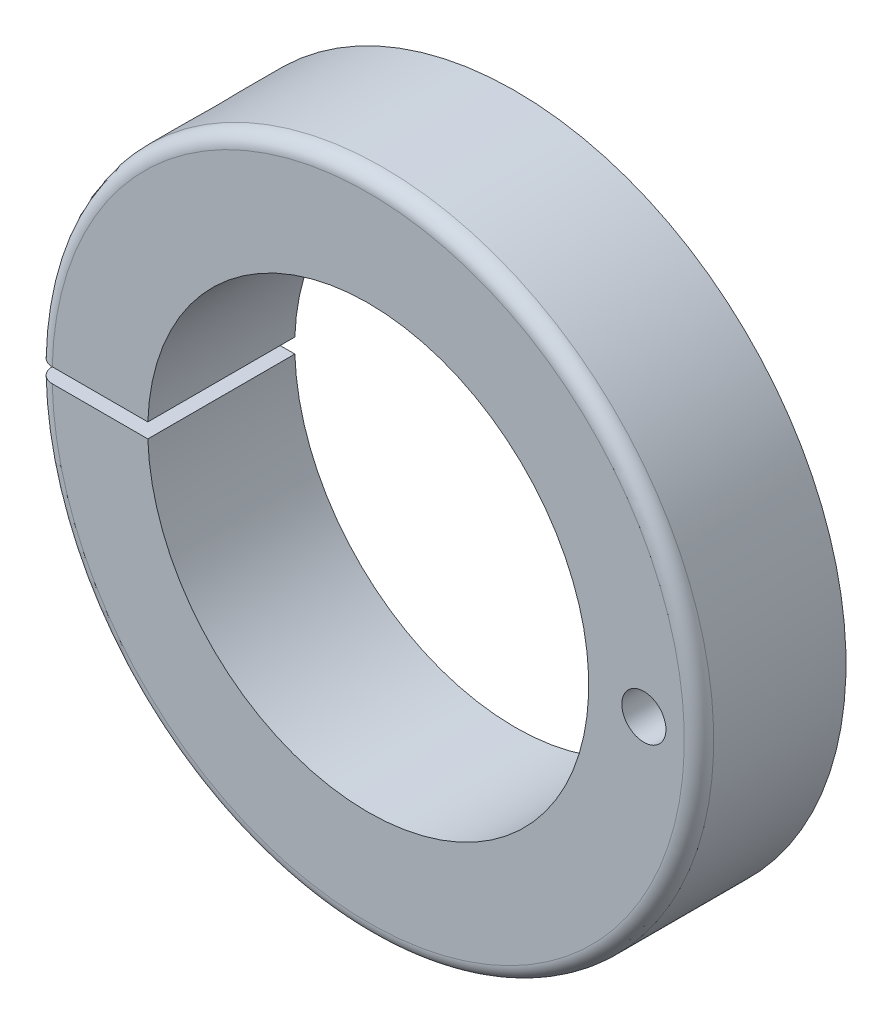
ISO-10303-21;
HEADER;
FILE_DESCRIPTION(('STEP AP214'),'2;1');
FILE_NAME('part.step','',(''),(''),'','','');
FILE_SCHEMA(('AUTOMOTIVE_DESIGN { 1 0 10303 214 1 1 1 1 }'));
ENDSEC;
DATA;
#1=APPLICATION_CONTEXT('core data for automotive mechanical design processes');
#2=APPLICATION_PROTOCOL_DEFINITION('international standard','automotive_design',2000,#1);
#3=PRODUCT_CONTEXT('',#1,'mechanical');
#4=PRODUCT('Part','Part','',(#3));
#5=PRODUCT_RELATED_PRODUCT_CATEGORY('part','',(#4));
#6=PRODUCT_DEFINITION_FORMATION('','',#4);
#7=PRODUCT_DEFINITION_CONTEXT('part definition',#1,'design');
#8=PRODUCT_DEFINITION('design','',#6,#7);
#9=PRODUCT_DEFINITION_SHAPE('','',#8);
#10=(LENGTH_UNIT() NAMED_UNIT(*) SI_UNIT(.MILLI.,.METRE.));
#11=(NAMED_UNIT(*) PLANE_ANGLE_UNIT() SI_UNIT($,.RADIAN.));
#12=(NAMED_UNIT(*) SI_UNIT($,.STERADIAN.) SOLID_ANGLE_UNIT());
#13=UNCERTAINTY_MEASURE_WITH_UNIT(LENGTH_MEASURE(1.E-05),#10,'distance_accuracy_value','');
#14=(GEOMETRIC_REPRESENTATION_CONTEXT(3) GLOBAL_UNCERTAINTY_ASSIGNED_CONTEXT((#13)) GLOBAL_UNIT_ASSIGNED_CONTEXT((#10,
#11,#12)) REPRESENTATION_CONTEXT('',''));
#15=CARTESIAN_POINT('',(0.,0.,0.));
#16=DIRECTION('',(0.,0.,1.));
#17=DIRECTION('',(1.,0.,0.));
#18=AXIS2_PLACEMENT_3D('',#15,#16,#17);
#19=CARTESIAN_POINT('',(-37.5,-45.,10.));
#20=DIRECTION('',(0.,1.,0.));
#21=DIRECTION('',(0.,0.,1.));
#22=AXIS2_PLACEMENT_3D('',#19,#20,#21);
#23=CYLINDRICAL_SURFACE('',#22,3.);
#24=CARTESIAN_POINT('',(-37.5,1.,10.));
#25=DIRECTION('',(0.,1.,0.));
#26=DIRECTION('',(0.,0.,1.));
#27=AXIS2_PLACEMENT_3D('',#24,#25,#26);
#28=CIRCLE('',#27,3.);
#29=CARTESIAN_POINT('',(-37.5,0.999999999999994,13.));
#30=VERTEX_POINT('',#29);
#31=EDGE_CURVE('E119',#30,#30,#28,.T.);
#32=CARTESIAN_POINT('',(-37.5,5.,10.));
#33=DIRECTION('',(0.,1.,0.));
#34=DIRECTION('',(0.,0.,1.));
#35=AXIS2_PLACEMENT_3D('',#32,#33,#34);
#36=CIRCLE('',#35,3.);
#37=CARTESIAN_POINT('',(-37.5,5.,13.));
#38=VERTEX_POINT('',#37);
#39=EDGE_CURVE('E124',#38,#38,#36,.F.);
#40=CARTESIAN_POINT('',(-37.5,0.999999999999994,13.));
#41=CARTESIAN_POINT('',(-37.5,1.04166666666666,13.));
#42=CARTESIAN_POINT('',(-37.5,1.08333333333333,13.));
#43=CARTESIAN_POINT('',(-37.5,1.16666666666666,13.));
#44=CARTESIAN_POINT('',(-37.5,1.20833333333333,13.));
#45=CARTESIAN_POINT('',(-37.5,1.29166666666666,13.));
#46=CARTESIAN_POINT('',(-37.5,1.33333333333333,13.));
#47=CARTESIAN_POINT('',(-37.5,1.41666666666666,13.));
#48=CARTESIAN_POINT('',(-37.5,1.45833333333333,13.));
#49=CARTESIAN_POINT('',(-37.5,1.54166666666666,13.));
#50=CARTESIAN_POINT('',(-37.5,1.58333333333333,13.));
#51=CARTESIAN_POINT('',(-37.5,1.66666666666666,13.));
#52=CARTESIAN_POINT('',(-37.5,1.70833333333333,13.));
#53=CARTESIAN_POINT('',(-37.5,1.79166666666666,13.));
#54=CARTESIAN_POINT('',(-37.5,1.83333333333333,13.));
#55=CARTESIAN_POINT('',(-37.5,1.91666666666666,13.));
#56=CARTESIAN_POINT('',(-37.5,1.95833333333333,13.));
#57=CARTESIAN_POINT('',(-37.5,2.04166666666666,13.));
#58=CARTESIAN_POINT('',(-37.5,2.08333333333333,13.));
#59=CARTESIAN_POINT('',(-37.5,2.16666666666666,13.));
#60=CARTESIAN_POINT('',(-37.5,2.20833333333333,13.));
#61=CARTESIAN_POINT('',(-37.5,2.29166666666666,13.));
#62=CARTESIAN_POINT('',(-37.5,2.33333333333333,13.));
#63=CARTESIAN_POINT('',(-37.5,2.41666666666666,13.));
#64=CARTESIAN_POINT('',(-37.5,2.45833333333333,13.));
#65=CARTESIAN_POINT('',(-37.5,2.54166666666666,13.));
#66=CARTESIAN_POINT('',(-37.5,2.58333333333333,13.));
#67=CARTESIAN_POINT('',(-37.5,2.66666666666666,13.));
#68=CARTESIAN_POINT('',(-37.5,2.70833333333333,13.));
#69=CARTESIAN_POINT('',(-37.5,2.79166666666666,13.));
#70=CARTESIAN_POINT('',(-37.5,2.83333333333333,13.));
#71=CARTESIAN_POINT('',(-37.5,2.91666666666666,13.));
#72=CARTESIAN_POINT('',(-37.5,2.95833333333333,13.));
#73=CARTESIAN_POINT('',(-37.5,3.04166666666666,13.));
#74=CARTESIAN_POINT('',(-37.5,3.08333333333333,13.));
#75=CARTESIAN_POINT('',(-37.5,3.16666666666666,13.));
#76=CARTESIAN_POINT('',(-37.5,3.20833333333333,13.));
#77=CARTESIAN_POINT('',(-37.5,3.29166666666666,13.));
#78=CARTESIAN_POINT('',(-37.5,3.33333333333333,13.));
#79=CARTESIAN_POINT('',(-37.5,3.41666666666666,13.));
#80=CARTESIAN_POINT('',(-37.5,3.45833333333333,13.));
#81=CARTESIAN_POINT('',(-37.5,3.54166666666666,13.));
#82=CARTESIAN_POINT('',(-37.5,3.58333333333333,13.));
#83=CARTESIAN_POINT('',(-37.5,3.66666666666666,13.));
#84=CARTESIAN_POINT('',(-37.5,3.70833333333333,13.));
#85=CARTESIAN_POINT('',(-37.5,3.79166666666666,13.));
#86=CARTESIAN_POINT('',(-37.5,3.83333333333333,13.));
#87=CARTESIAN_POINT('',(-37.5,3.91666666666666,13.));
#88=CARTESIAN_POINT('',(-37.5,3.95833333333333,13.));
#89=CARTESIAN_POINT('',(-37.5,4.04166666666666,13.));
#90=CARTESIAN_POINT('',(-37.5,4.08333333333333,13.));
#91=CARTESIAN_POINT('',(-37.5,4.16666666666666,13.));
#92=CARTESIAN_POINT('',(-37.5,4.20833333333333,13.));
#93=CARTESIAN_POINT('',(-37.5,4.29166666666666,13.));
#94=CARTESIAN_POINT('',(-37.5,4.33333333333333,13.));
#95=CARTESIAN_POINT('',(-37.5,4.41666666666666,13.));
#96=CARTESIAN_POINT('',(-37.5,4.45833333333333,13.));
#97=CARTESIAN_POINT('',(-37.5,4.54166666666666,13.));
#98=CARTESIAN_POINT('',(-37.5,4.58333333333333,13.));
#99=CARTESIAN_POINT('',(-37.5,4.66666666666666,13.));
#100=CARTESIAN_POINT('',(-37.5,4.70833333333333,13.));
#101=CARTESIAN_POINT('',(-37.5,4.79166666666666,13.));
#102=CARTESIAN_POINT('',(-37.5,4.83333333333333,13.));
#103=CARTESIAN_POINT('',(-37.5,4.91666666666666,13.));
#104=CARTESIAN_POINT('',(-37.5,4.95833333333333,13.));
#105=CARTESIAN_POINT('',(-37.5,5.,13.));
#106=B_SPLINE_CURVE_WITH_KNOTS('',3,(#40,#41,#42,#43,#44,#45,#46,#47,#48,#49,#50,#51,#52,#53,
#54,#55,#56,#57,#58,#59,#60,#61,#62,#63,#64,#65,#66,#67,#68,#69,#70,#71,#72,#73,#74,#75,#76,#77,
#78,#79,#80,#81,#82,#83,#84,#85,#86,#87,#88,#89,#90,#91,#92,#93,#94,#95,#96,#97,#98,#99,#100,
#101,#102,#103,#104,#105),.UNSPECIFIED.,.F.,.F.,(4,2,2,2,2,2,2,2,2,2,2,2,2,2,2,2,2,2,2,2,2,2,2,
2,2,2,2,2,2,2,2,2,4),(0.,0.125,0.25,0.375,0.5,0.625000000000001,0.750000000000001,
0.875000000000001,1.,1.125,1.25,1.375,1.5,1.625,1.75,1.875,2.,2.125,2.25,2.375,2.5,2.625,2.75,
2.875,3.,3.125,3.25,3.375,3.5,3.625,3.75,3.875,4.),.UNSPECIFIED.);
#107=EDGE_CURVE('BSEAM33',#30,#38,#106,.T.);
#108=ORIENTED_EDGE('',*,*,#31,.F.);
#109=ORIENTED_EDGE('',*,*,#39,.F.);
#110=ORIENTED_EDGE('',*,*,#107,.T.);
#111=ORIENTED_EDGE('',*,*,#107,.F.);
#112=EDGE_LOOP('',(#108,#110,#109,#111));
#113=FACE_BOUND('',#112,.T.);
#114=ADVANCED_FACE('F33',(#113),#23,.F.);
#115=CARTESIAN_POINT('',(0.,0.,20.));
#116=DIRECTION('',(0.,0.,-1.));
#117=DIRECTION('',(-1.,0.,0.));
#118=AXIS2_PLACEMENT_3D('',#115,#116,#117);
#119=CYLINDRICAL_SURFACE('',#118,45.);
#120=CARTESIAN_POINT('',(-37.5,24.8746859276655,17.));
#121=CARTESIAN_POINT('',(-37.8264549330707,24.382530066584,17.0000078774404));
#122=CARTESIAN_POINT('',(-38.1432428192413,23.8838821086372,16.977229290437));
#123=CARTESIAN_POINT('',(-38.7556311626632,22.8768191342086,16.893397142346));
#124=CARTESIAN_POINT('',(-39.0512212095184,22.3683994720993,16.8323249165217));
#125=CARTESIAN_POINT('',(-39.6210724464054,21.3428143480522,16.6774589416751));
#126=CARTESIAN_POINT('',(-39.8952710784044,20.8256282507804,16.5835733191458));
#127=CARTESIAN_POINT('',(-40.421051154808,19.7858034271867,16.3677477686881));
#128=CARTESIAN_POINT('',(-40.6726360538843,19.2631655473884,16.2458121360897));
#129=CARTESIAN_POINT('',(-41.0670923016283,18.4019310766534,16.0255293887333));
#130=CARTESIAN_POINT('',(-41.216615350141,18.0644939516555,15.9343864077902));
#131=CARTESIAN_POINT('',(-41.5064079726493,17.3883114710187,15.7427241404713));
#132=CARTESIAN_POINT('',(-41.6466777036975,17.0495661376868,15.6422050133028));
#133=CARTESIAN_POINT('',(-41.9180759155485,16.3709657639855,15.4323150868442));
#134=CARTESIAN_POINT('',(-42.0492000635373,16.0311102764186,15.322940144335));
#135=CARTESIAN_POINT('',(-42.3022943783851,15.3508174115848,15.0957714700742));
#136=CARTESIAN_POINT('',(-42.4242647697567,15.0103800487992,14.9779779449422));
#137=CARTESIAN_POINT('',(-42.6589133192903,14.3299131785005,14.7343605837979));
#138=CARTESIAN_POINT('',(-42.7716072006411,13.9898839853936,14.6085510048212));
#139=CARTESIAN_POINT('',(-42.9879918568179,13.3101374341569,14.3486264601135));
#140=CARTESIAN_POINT('',(-43.0916827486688,12.9704200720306,14.2145116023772));
#141=CARTESIAN_POINT('',(-43.2900398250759,12.2921610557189,13.937567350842));
#142=CARTESIAN_POINT('',(-43.3847114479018,11.9536188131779,13.7947432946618));
#143=CARTESIAN_POINT('',(-43.5650963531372,11.2784909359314,13.4992332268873));
#144=CARTESIAN_POINT('',(-43.6508111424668,10.9419049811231,13.3465488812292));
#145=CARTESIAN_POINT('',(-43.7659478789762,10.4672137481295,13.1214454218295));
#146=CARTESIAN_POINT('',(-43.7990943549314,10.3276213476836,13.0540393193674));
#147=CARTESIAN_POINT('',(-43.8637991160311,10.0492554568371,12.9168173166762));
#148=CARTESIAN_POINT('',(-43.8953574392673,9.91048194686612,12.8470014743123));
#149=CARTESIAN_POINT('',(-43.9568198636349,9.63420897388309,12.7047134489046));
#150=CARTESIAN_POINT('',(-43.9867264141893,9.49670789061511,12.6322454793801));
#151=CARTESIAN_POINT('',(-44.0449044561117,9.22312026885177,12.4840614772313));
#152=CARTESIAN_POINT('',(-44.0731760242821,9.08703366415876,12.4083455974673));
#153=CARTESIAN_POINT('',(-44.1355252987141,8.77987489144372,12.2317754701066));
#154=CARTESIAN_POINT('',(-44.1690810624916,8.60939392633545,12.1297014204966));
#155=CARTESIAN_POINT('',(-44.2333930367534,8.27262529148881,11.9167400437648));
#156=CARTESIAN_POINT('',(-44.264140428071,8.10635194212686,11.8058268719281));
#157=CARTESIAN_POINT('',(-44.3081612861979,7.86091839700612,11.6287230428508));
#158=CARTESIAN_POINT('',(-44.322657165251,7.77873934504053,11.5670326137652));
#159=CARTESIAN_POINT('',(-44.3506709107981,7.61739289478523,11.4396431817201));
#160=CARTESIAN_POINT('',(-44.3641891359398,7.53822439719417,11.3739456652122));
#161=CARTESIAN_POINT('',(-44.390041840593,7.38445913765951,11.2377837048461));
#162=CARTESIAN_POINT('',(-44.4023811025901,7.3098443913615,11.1673406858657));
#163=CARTESIAN_POINT('',(-44.4256667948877,7.1669614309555,11.02014447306));
#164=CARTESIAN_POINT('',(-44.4366154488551,7.09868313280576,10.9434016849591));
#165=CARTESIAN_POINT('',(-44.4539528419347,6.98915420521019,10.8037699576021));
#166=CARTESIAN_POINT('',(-44.460772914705,6.94559585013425,10.7427692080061));
#167=CARTESIAN_POINT('',(-44.473150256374,6.86589608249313,10.6158275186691));
#168=CARTESIAN_POINT('',(-44.4787069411,6.82975810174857,10.5498843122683));
#169=CARTESIAN_POINT('',(-44.4882173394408,6.76753517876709,10.411898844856));
#170=CARTESIAN_POINT('',(-44.4921450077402,6.74161388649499,10.339778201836));
#171=CARTESIAN_POINT('',(-44.497758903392,6.70446367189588,10.1918126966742));
#172=CARTESIAN_POINT('',(-44.4994522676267,6.69318796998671,10.1159804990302));
#173=CARTESIAN_POINT('',(-44.500265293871,6.68777897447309,9.9734616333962));
#174=CARTESIAN_POINT('',(-44.4996874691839,6.69163070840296,9.90685073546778));
#175=CARTESIAN_POINT('',(-44.4967076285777,6.71141594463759,9.77546340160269));
#176=CARTESIAN_POINT('',(-44.4943028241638,6.72736791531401,9.71068992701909));
#177=CARTESIAN_POINT('',(-44.4870799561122,6.77498537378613,9.56733982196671));
#178=CARTESIAN_POINT('',(-44.4817810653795,6.80975962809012,9.48984677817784));
#179=CARTESIAN_POINT('',(-44.4693319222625,6.8905870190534,9.34120216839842));
#180=CARTESIAN_POINT('',(-44.4621772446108,6.93666710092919,9.27006631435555));
#181=CARTESIAN_POINT('',(-44.4448038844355,7.04721014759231,9.11869133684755));
#182=CARTESIAN_POINT('',(-44.4342572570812,7.11349100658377,9.03984403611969));
#183=CARTESIAN_POINT('',(-44.4116723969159,7.25316427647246,8.88886844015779));
#184=CARTESIAN_POINT('',(-44.39963136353,7.32656998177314,8.81675321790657));
#185=CARTESIAN_POINT('',(-44.3742944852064,7.4784997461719,8.67746011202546));
#186=CARTESIAN_POINT('',(-44.3609914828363,7.55705210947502,8.61031477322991));
#187=CARTESIAN_POINT('',(-44.3333852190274,7.7173559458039,8.48038174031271));
#188=CARTESIAN_POINT('',(-44.3190828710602,7.79910446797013,8.4175901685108));
#189=CARTESIAN_POINT('',(-44.275544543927,8.04382230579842,8.23730139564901));
#190=CARTESIAN_POINT('',(-44.2450452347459,8.21007799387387,8.12458633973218));
#191=CARTESIAN_POINT('',(-44.1810511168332,8.54777044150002,7.90805475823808));
#192=CARTESIAN_POINT('',(-44.1475541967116,8.71921079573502,7.80424460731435));
#193=CARTESIAN_POINT('',(-44.0776976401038,9.06575303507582,7.6030749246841));
#194=CARTESIAN_POINT('',(-44.0413320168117,9.24086198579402,7.50572970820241));
#195=CARTESIAN_POINT('',(-43.965905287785,9.59331391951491,7.31626123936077));
#196=CARTESIAN_POINT('',(-43.9268439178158,9.77065712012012,7.22413850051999));
#197=CARTESIAN_POINT('',(-43.8460251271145,10.1271683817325,7.04403662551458));
#198=CARTESIAN_POINT('',(-43.804263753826,10.3063387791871,6.95606390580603));
#199=CARTESIAN_POINT('',(-43.7181277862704,10.6658089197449,6.78376755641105));
#200=CARTESIAN_POINT('',(-43.6737530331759,10.8461087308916,6.69944414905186));
#201=CARTESIAN_POINT('',(-43.5368560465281,11.387742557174,6.45146986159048));
#202=CARTESIAN_POINT('',(-43.4404536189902,11.7502863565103,6.29257840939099));
#203=CARTESIAN_POINT('',(-43.2374644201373,12.4765278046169,5.98561930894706));
#204=CARTESIAN_POINT('',(-43.1308898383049,12.8402235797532,5.83753907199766));
#205=CARTESIAN_POINT('',(-42.9074134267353,13.568304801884,5.55108118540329));
#206=CARTESIAN_POINT('',(-42.7905106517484,13.9326903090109,5.41270442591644));
#207=CARTESIAN_POINT('',(-42.5462198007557,14.6617573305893,5.14526170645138));
#208=CARTESIAN_POINT('',(-42.418822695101,15.0264388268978,5.01620394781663));
#209=CARTESIAN_POINT('',(-42.1535574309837,15.755252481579,4.76765496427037));
#210=CARTESIAN_POINT('',(-42.0156893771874,16.1193846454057,4.64816364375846));
#211=CARTESIAN_POINT('',(-41.7297895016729,16.8456691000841,4.4194715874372));
#212=CARTESIAN_POINT('',(-41.5817859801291,17.2078240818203,4.310244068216));
#213=CARTESIAN_POINT('',(-41.2752156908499,17.930719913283,4.10236948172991));
#214=CARTESIAN_POINT('',(-41.1166485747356,18.2914607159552,4.0037227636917));
#215=CARTESIAN_POINT('',(-40.7890107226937,19.010857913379,3.81794115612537));
#216=CARTESIAN_POINT('',(-40.6199466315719,19.3695154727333,3.73079909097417));
#217=CARTESIAN_POINT('',(-40.271235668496,20.0844656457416,3.56904456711));
#218=CARTESIAN_POINT('',(-40.0915898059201,20.4407584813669,3.49443091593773));
#219=CARTESIAN_POINT('',(-39.6801226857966,21.2303582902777,3.34377852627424));
#220=CARTESIAN_POINT('',(-39.4456555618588,21.662958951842,3.27119536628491));
#221=CARTESIAN_POINT('',(-38.9611098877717,22.5227755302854,3.14963127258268));
#222=CARTESIAN_POINT('',(-38.7110306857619,22.9499912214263,3.10065132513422));
#223=CARTESIAN_POINT('',(-38.1958070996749,23.7976108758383,3.02981480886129));
#224=CARTESIAN_POINT('',(-37.9306625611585,24.2180147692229,3.0079585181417));
#225=CARTESIAN_POINT('',(-37.3863425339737,25.0501163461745,2.9956309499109));
#226=CARTESIAN_POINT('',(-37.1071707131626,25.4618162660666,3.00515150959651));
#227=CARTESIAN_POINT('',(-36.6049575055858,26.1766989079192,3.05404031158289));
#228=CARTESIAN_POINT('',(-36.3845087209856,26.4822305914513,3.08570397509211));
#229=CARTESIAN_POINT('',(-35.9376238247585,27.0855689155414,3.17278861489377));
#230=CARTESIAN_POINT('',(-35.7111872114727,27.3833749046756,3.22821158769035));
#231=CARTESIAN_POINT('',(-35.2544094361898,27.9689881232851,3.3656857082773));
#232=CARTESIAN_POINT('',(-35.0240751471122,28.2568106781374,3.44769384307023));
#233=CARTESIAN_POINT('',(-34.561586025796,28.820643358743,3.64165415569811));
#234=CARTESIAN_POINT('',(-34.3294321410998,29.0966592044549,3.75359163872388));
#235=CARTESIAN_POINT('',(-33.9477187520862,29.5398987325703,3.96585797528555));
#236=CARTESIAN_POINT('',(-33.7977001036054,29.7113771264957,4.05652912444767));
#237=CARTESIAN_POINT('',(-33.499549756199,30.0471382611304,4.25297728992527));
#238=CARTESIAN_POINT('',(-33.3514175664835,30.2114229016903,4.35875028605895));
#239=CARTESIAN_POINT('',(-33.0585804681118,30.5315780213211,4.58630211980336));
#240=CARTESIAN_POINT('',(-32.9138732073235,30.6874543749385,4.70806957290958));
#241=CARTESIAN_POINT('',(-32.6296668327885,30.9894810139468,4.96839590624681));
#242=CARTESIAN_POINT('',(-32.49016651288,31.1356335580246,5.10695086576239));
#243=CARTESIAN_POINT('',(-32.1412524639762,31.4965592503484,5.48532513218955));
#244=CARTESIAN_POINT('',(-31.937002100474,31.7033017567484,5.73804497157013));
#245=CARTESIAN_POINT('',(-31.651874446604,31.9871392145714,6.14937397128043));
#246=CARTESIAN_POINT('',(-31.5603811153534,32.0773647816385,6.29184301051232));
#247=CARTESIAN_POINT('',(-31.3858030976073,32.2481969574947,6.58737578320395));
#248=CARTESIAN_POINT('',(-31.3027169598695,32.328805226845,6.74043768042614));
#249=CARTESIAN_POINT('',(-31.1599236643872,32.4664018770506,7.0293509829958));
#250=CARTESIAN_POINT('',(-31.0986532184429,32.5250682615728,7.16363525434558));
#251=CARTESIAN_POINT('',(-30.9837818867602,32.6345146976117,7.43853951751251));
#252=CARTESIAN_POINT('',(-30.9301794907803,32.685296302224,7.57915825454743));
#253=CARTESIAN_POINT('',(-30.831476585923,32.7784176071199,7.8660365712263));
#254=CARTESIAN_POINT('',(-30.7863742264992,32.8207591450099,8.01229491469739));
#255=CARTESIAN_POINT('',(-30.7054170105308,32.8965111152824,8.30962188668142));
#256=CARTESIAN_POINT('',(-30.6695622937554,32.9299214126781,8.46069058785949));
#257=CARTESIAN_POINT('',(-30.6076002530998,32.9875220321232,8.76735472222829));
#258=CARTESIAN_POINT('',(-30.581541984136,33.0116659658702,8.92296883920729));
#259=CARTESIAN_POINT('',(-30.5399296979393,33.0501664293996,9.23679972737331));
#260=CARTESIAN_POINT('',(-30.5243757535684,33.0645228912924,9.39501651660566));
#261=CARTESIAN_POINT('',(-30.5040878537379,33.0832407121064,9.71269943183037));
#262=CARTESIAN_POINT('',(-30.4993516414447,33.0876041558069,9.8721652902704));
#263=CARTESIAN_POINT('',(-30.5007908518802,33.0862775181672,10.1909995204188));
#264=CARTESIAN_POINT('',(-30.5069655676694,33.0805880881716,10.3503678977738));
#265=CARTESIAN_POINT('',(-30.5291249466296,33.0601380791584,10.6543252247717));
#266=CARTESIAN_POINT('',(-30.5442435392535,33.0461782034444,10.7990328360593));
#267=CARTESIAN_POINT('',(-30.583278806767,33.0100555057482,11.086269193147));
#268=CARTESIAN_POINT('',(-30.6071984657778,32.9878899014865,11.2287971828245));
#269=CARTESIAN_POINT('',(-30.663434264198,32.93562309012,11.5106323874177));
#270=CARTESIAN_POINT('',(-30.6957467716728,32.9055253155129,11.6499409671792));
#271=CARTESIAN_POINT('',(-30.76828540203,32.8377081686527,11.9246324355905));
#272=CARTESIAN_POINT('',(-30.8085144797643,32.7999859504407,12.0600138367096));
#273=CARTESIAN_POINT('',(-30.8975206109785,32.716158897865,12.3298052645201));
#274=CARTESIAN_POINT('',(-30.9465040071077,32.6698503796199,12.4640839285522));
#275=CARTESIAN_POINT('',(-31.0515200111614,32.5700531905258,12.7271221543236));
#276=CARTESIAN_POINT('',(-31.107555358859,32.5165617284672,12.8558795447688));
#277=CARTESIAN_POINT('',(-31.2851790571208,32.3460109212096,13.2331283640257));
#278=CARTESIAN_POINT('',(-31.4163260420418,32.2188369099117,13.4727178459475));
#279=CARTESIAN_POINT('',(-31.6579513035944,31.9811527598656,13.8609564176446));
#280=CARTESIAN_POINT('',(-31.7637095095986,31.8761800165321,14.0160980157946));
#281=CARTESIAN_POINT('',(-31.9832916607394,31.6558579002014,14.3127684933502));
#282=CARTESIAN_POINT('',(-32.0971183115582,31.540505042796,14.4542927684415));
#283=CARTESIAN_POINT('',(-32.4483303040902,31.1804043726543,14.858833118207));
#284=CARTESIAN_POINT('',(-32.6952529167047,30.9218040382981,15.1015145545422));
#285=CARTESIAN_POINT('',(-33.1276803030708,30.4569615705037,15.4716075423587));
#286=CARTESIAN_POINT('',(-33.309957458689,30.2576088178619,15.6119511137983));
#287=CARTESIAN_POINT('',(-33.6782207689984,29.8471661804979,15.8689335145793));
#288=CARTESIAN_POINT('',(-33.864208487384,29.6360712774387,15.985562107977));
#289=CARTESIAN_POINT('',(-34.2375200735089,29.2040049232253,16.1969602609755));
#290=CARTESIAN_POINT('',(-34.424845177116,28.9830229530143,16.2917058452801));
#291=CARTESIAN_POINT('',(-34.7987688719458,28.5329857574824,16.4610728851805));
#292=CARTESIAN_POINT('',(-34.9853675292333,28.3039312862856,16.5356962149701));
#293=CARTESIAN_POINT('',(-35.3732459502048,27.8179560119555,16.6725531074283));
#294=CARTESIAN_POINT('',(-35.5743248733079,27.5603901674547,16.7330525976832));
#295=CARTESIAN_POINT('',(-35.9725843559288,27.0385089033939,16.8344145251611));
#296=CARTESIAN_POINT('',(-36.1697646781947,26.7741930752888,16.8752757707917));
#297=CARTESIAN_POINT('',(-36.5590890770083,26.2400864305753,16.9392779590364));
#298=CARTESIAN_POINT('',(-36.7512365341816,25.9702995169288,16.9624311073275));
#299=CARTESIAN_POINT('',(-37.1299415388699,25.4259214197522,16.9927914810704));
#300=CARTESIAN_POINT('',(-37.3164979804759,25.1513293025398,16.9999955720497));
#301=CARTESIAN_POINT('',(-37.5,24.8746859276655,17.));
#302=B_SPLINE_CURVE_WITH_KNOTS('',3,(#120,#121,#122,#123,#124,#125,#126,#127,#128,#129,#130,
#131,#132,#133,#134,#135,#136,#137,#138,#139,#140,#141,#142,#143,#144,#145,#146,#147,#148,#149,
#150,#151,#152,#153,#154,#155,#156,#157,#158,#159,#160,#161,#162,#163,#164,#165,#166,#167,#168,
#169,#170,#171,#172,#173,#174,#175,#176,#177,#178,#179,#180,#181,#182,#183,#184,#185,#186,#187,
#188,#189,#190,#191,#192,#193,#194,#195,#196,#197,#198,#199,#200,#201,#202,#203,#204,#205,#206,
#207,#208,#209,#210,#211,#212,#213,#214,#215,#216,#217,#218,#219,#220,#221,#222,#223,#224,#225,
#226,#227,#228,#229,#230,#231,#232,#233,#234,#235,#236,#237,#238,#239,#240,#241,#242,#243,#244,
#245,#246,#247,#248,#249,#250,#251,#252,#253,#254,#255,#256,#257,#258,#259,#260,#261,#262,#263,
#264,#265,#266,#267,#268,#269,#270,#271,#272,#273,#274,#275,#276,#277,#278,#279,#280,#281,#282,
#283,#284,#285,#286,#287,#288,#289,#290,#291,#292,#293,#294,#295,#296,#297,#298,#299,#300,#301),
.UNSPECIFIED.,.T.,.F.,(4,2,2,2,2,2,2,2,2,2,2,2,2,2,2,2,2,2,2,2,2,2,2,2,2,2,2,2,2,2,2,2,2,2,2,2,
2,2,2,2,2,2,2,2,2,2,2,2,2,2,2,2,2,2,2,2,2,2,2,2,2,2,2,2,2,2,2,2,2,2,2,2,2,2,2,2,2,2,2,2,2,2,2,2,
2,2,2,2,2,2,4),(0.,1.77148044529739,3.54382500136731,5.3211721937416,7.09824739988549,
8.23854255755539,9.37881835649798,10.5196307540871,11.6604151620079,12.7992243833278,
13.9380187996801,15.0761221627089,16.214033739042,16.6895695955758,17.1650940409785,
17.639893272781,18.1146701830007,18.7190595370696,19.3252859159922,19.6365203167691,
19.947639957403,20.2574385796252,20.5667354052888,20.7921401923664,21.0176489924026,
21.2466359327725,21.4748896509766,21.6738390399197,21.8730926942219,22.1269668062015,
22.3814519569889,22.6913646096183,23.0018670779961,23.3142499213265,23.6263508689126,
24.2353487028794,24.844778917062,25.4555164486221,26.0663139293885,26.67802674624,
27.289776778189,28.5116529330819,29.7320828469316,30.9526245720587,32.1742276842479,
33.3958185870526,34.6141276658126,35.8324769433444,37.0500626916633,38.2675324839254,
39.7588915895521,41.2503130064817,42.7417497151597,44.2327984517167,45.3663095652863,
46.4999159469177,47.6316973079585,48.7629240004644,49.4980793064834,50.233039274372,
50.9674789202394,51.7017473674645,52.8519835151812,53.4269891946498,54.0018954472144,
54.4779315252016,54.9538737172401,55.4297121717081,55.9055578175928,56.383755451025,
56.8619564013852,57.3400575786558,57.81812777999,58.2561076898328,58.6942362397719,
59.1321755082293,59.5702785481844,60.0205469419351,60.4709908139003,61.3714813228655,
62.0160286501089,62.6607931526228,63.9515261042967,64.8636873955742,65.7762415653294,
66.6897908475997,67.6032550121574,68.5994446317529,69.5956946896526,70.5912574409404,
71.5870158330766),.UNSPECIFIED.);
#303=CARTESIAN_POINT('',(-37.5,24.8746859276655,17.));
#304=VERTEX_POINT('',#303);
#305=EDGE_CURVE('E123',#304,#304,#302,.T.);
#306=ORIENTED_EDGE('',*,*,#305,.T.);
#307=EDGE_LOOP('',(#306));
#308=FACE_BOUND('',#307,.T.);
#309=CARTESIAN_POINT('',(-37.5,-24.8746859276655,13.));
#310=CARTESIAN_POINT('',(-37.3637731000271,-25.0800558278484,12.9999995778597));
#311=CARTESIAN_POINT('',(-37.2258500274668,-25.2843131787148,12.9907483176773));
#312=CARTESIAN_POINT('',(-36.9474715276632,-25.6893895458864,12.9520290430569));
#313=CARTESIAN_POINT('',(-36.8070148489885,-25.8902067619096,12.9225507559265));
#314=CARTESIAN_POINT('',(-36.5258886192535,-26.2853169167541,12.8411971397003));
#315=CARTESIAN_POINT('',(-36.3852255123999,-26.4796420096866,12.7894585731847));
#316=CARTESIAN_POINT('',(-36.1051013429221,-26.8603290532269,12.6604534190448));
#317=CARTESIAN_POINT('',(-35.9656387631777,-27.0467028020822,12.5832262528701));
#318=CARTESIAN_POINT('',(-35.7207735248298,-27.3689257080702,12.4189144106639));
#319=CARTESIAN_POINT('',(-35.6145049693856,-27.507010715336,12.3375360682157));
#320=CARTESIAN_POINT('',(-35.4070910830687,-27.7734821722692,12.1538225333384));
#321=CARTESIAN_POINT('',(-35.3059522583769,-27.9018564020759,12.0514615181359));
#322=CARTESIAN_POINT('',(-35.160659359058,-28.0844129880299,11.8796779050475));
#323=CARTESIAN_POINT('',(-35.1129957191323,-28.1439679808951,11.8188989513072));
#324=CARTESIAN_POINT('',(-35.0208001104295,-28.2586089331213,11.6910949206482));
#325=CARTESIAN_POINT('',(-34.976268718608,-28.3136940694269,11.6240686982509));
#326=CARTESIAN_POINT('',(-34.848893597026,-28.4705557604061,11.4136260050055));
#327=CARTESIAN_POINT('',(-34.7717875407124,-28.564540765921,11.2603000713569));
#328=CARTESIAN_POINT('',(-34.6672411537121,-28.6912250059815,10.9936514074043));
#329=CARTESIAN_POINT('',(-34.6321323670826,-28.7335611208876,10.8878429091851));
#330=CARTESIAN_POINT('',(-34.5732674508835,-28.8043623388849,10.6686302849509));
#331=CARTESIAN_POINT('',(-34.5495020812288,-28.8328387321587,10.5552324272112));
#332=CARTESIAN_POINT('',(-34.5151024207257,-28.8740101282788,10.3228795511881));
#333=CARTESIAN_POINT('',(-34.5045486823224,-28.8866083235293,10.2038949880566));
#334=CARTESIAN_POINT('',(-34.4978272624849,-28.8946352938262,9.96494132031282));
#335=CARTESIAN_POINT('',(-34.5016562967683,-28.8900679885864,9.84497244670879));
#336=CARTESIAN_POINT('',(-34.5223785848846,-28.8653007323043,9.61842667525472));
#337=CARTESIAN_POINT('',(-34.5381195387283,-28.8464795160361,9.51158559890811));
#338=CARTESIAN_POINT('',(-34.5801190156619,-28.7961184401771,9.30313708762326));
#339=CARTESIAN_POINT('',(-34.6063814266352,-28.7645738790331,9.20153160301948));
#340=CARTESIAN_POINT('',(-34.6776399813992,-28.6786554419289,8.97400734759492));
#341=CARTESIAN_POINT('',(-34.7259393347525,-28.6202095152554,8.85066472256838));
#342=CARTESIAN_POINT('',(-34.8342090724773,-28.4883340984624,8.6179295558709));
#343=CARTESIAN_POINT('',(-34.8942009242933,-28.4148770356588,8.50856329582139));
#344=CARTESIAN_POINT('',(-35.0500326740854,-28.2226193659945,8.26004066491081));
#345=CARTESIAN_POINT('',(-35.1502098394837,-28.0978861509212,8.12823460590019));
#346=CARTESIAN_POINT('',(-35.3604970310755,-27.8327871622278,7.89103084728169));
#347=CARTESIAN_POINT('',(-35.4706267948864,-27.6923901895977,7.78568726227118));
#348=CARTESIAN_POINT('',(-35.6725726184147,-27.4315304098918,7.6180042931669));
#349=CARTESIAN_POINT('',(-35.7633936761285,-27.3130507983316,7.55127900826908));
#350=CARTESIAN_POINT('',(-35.946976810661,-27.0709796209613,7.43091891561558));
#351=CARTESIAN_POINT('',(-36.0397399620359,-26.9473851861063,7.37729157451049));
#352=CARTESIAN_POINT('',(-36.2261857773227,-26.696216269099,7.28184351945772));
#353=CARTESIAN_POINT('',(-36.319869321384,-26.568637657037,7.24003554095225));
#354=CARTESIAN_POINT('',(-36.5073192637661,-26.3104754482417,7.16721106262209));
#355=CARTESIAN_POINT('',(-36.6010856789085,-26.1798909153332,7.13619797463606));
#356=CARTESIAN_POINT('',(-36.8402142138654,-25.8430223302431,7.06954656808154));
#357=CARTESIAN_POINT('',(-36.985228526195,-25.6350816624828,7.04095132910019));
#358=CARTESIAN_POINT('',(-37.2725685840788,-25.2154794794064,7.00513106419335));
#359=CARTESIAN_POINT('',(-37.4148926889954,-25.0038158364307,6.99791868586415));
#360=CARTESIAN_POINT('',(-37.6961544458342,-24.5777391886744,7.0031090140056));
#361=CARTESIAN_POINT('',(-37.8350824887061,-24.3633205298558,7.01556201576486));
#362=CARTESIAN_POINT('',(-38.1083752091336,-23.9335865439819,7.05907828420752));
#363=CARTESIAN_POINT('',(-38.2427413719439,-23.7182715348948,7.09013543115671));
#364=CARTESIAN_POINT('',(-38.5112104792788,-23.2799301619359,7.17194862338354));
#365=CARTESIAN_POINT('',(-38.6451197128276,-23.0569132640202,7.22339105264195));
#366=CARTESIAN_POINT('',(-38.9068381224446,-22.6124838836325,7.34636850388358));
#367=CARTESIAN_POINT('',(-39.034642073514,-22.3910729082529,7.4179203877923));
#368=CARTESIAN_POINT('',(-39.2209339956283,-22.0620550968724,7.54156159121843));
#369=CARTESIAN_POINT('',(-39.2821375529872,-21.9528831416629,7.58550186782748));
#370=CARTESIAN_POINT('',(-39.4025732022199,-21.7359746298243,7.6792149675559));
#371=CARTESIAN_POINT('',(-39.4618056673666,-21.6282378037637,7.72898667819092));
#372=CARTESIAN_POINT('',(-39.5779822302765,-21.4149025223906,7.83478589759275));
#373=CARTESIAN_POINT('',(-39.6349302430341,-21.3093005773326,7.89080202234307));
#374=CARTESIAN_POINT('',(-39.7463555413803,-21.1007391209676,8.00988890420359));
#375=CARTESIAN_POINT('',(-39.8008323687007,-20.9977801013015,8.07296096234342));
#376=CARTESIAN_POINT('',(-39.9015812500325,-20.8056335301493,8.20046176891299));
#377=CARTESIAN_POINT('',(-39.948131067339,-20.7160931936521,8.26413492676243));
#378=CARTESIAN_POINT('',(-40.0383069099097,-20.5412666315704,8.39888495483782));
#379=CARTESIAN_POINT('',(-40.0819350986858,-20.4559772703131,8.46995624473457));
#380=CARTESIAN_POINT('',(-40.1651701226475,-20.2920546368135,8.62008031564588));
#381=CARTESIAN_POINT('',(-40.2048082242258,-20.213370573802,8.6990594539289));
#382=CARTESIAN_POINT('',(-40.2792260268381,-20.0646660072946,8.86673258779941));
#383=CARTESIAN_POINT('',(-40.3140167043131,-19.9946259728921,8.95540379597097));
#384=CARTESIAN_POINT('',(-40.3685420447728,-19.8842538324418,9.1186592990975));
#385=CARTESIAN_POINT('',(-40.3898194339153,-19.8409763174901,9.19071167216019));
#386=CARTESIAN_POINT('',(-40.4277215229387,-19.7636329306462,9.34088197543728));
#387=CARTESIAN_POINT('',(-40.4443456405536,-19.7295682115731,9.41900066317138));
#388=CARTESIAN_POINT('',(-40.4718169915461,-19.6731553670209,9.58148938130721));
#389=CARTESIAN_POINT('',(-40.4825961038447,-19.6509454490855,9.66592060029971));
#390=CARTESIAN_POINT('',(-40.4968553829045,-19.6215441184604,9.83793423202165));
#391=CARTESIAN_POINT('',(-40.5003470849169,-19.6143289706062,9.92551144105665));
#392=CARTESIAN_POINT('',(-40.4996366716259,-19.6157950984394,10.0911421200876));
#393=CARTESIAN_POINT('',(-40.4962129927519,-19.6228680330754,10.1692183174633));
#394=CARTESIAN_POINT('',(-40.483573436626,-19.6489308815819,10.3228734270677));
#395=CARTESIAN_POINT('',(-40.474352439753,-19.6679313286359,10.3984500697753));
#396=CARTESIAN_POINT('',(-40.4475700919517,-19.7229623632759,10.5665857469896));
#397=CARTESIAN_POINT('',(-40.4283727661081,-19.7623192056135,10.6577777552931));
#398=CARTESIAN_POINT('',(-40.3837143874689,-19.8534171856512,10.832068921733));
#399=CARTESIAN_POINT('',(-40.3582395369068,-19.9051855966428,10.9151496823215));
#400=CARTESIAN_POINT('',(-40.3073548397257,-20.0079950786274,11.0600063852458));
#401=CARTESIAN_POINT('',(-40.2826564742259,-20.0576905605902,11.1230140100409));
#402=CARTESIAN_POINT('',(-40.2307085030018,-20.1616836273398,11.2440108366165));
#403=CARTESIAN_POINT('',(-40.2034571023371,-20.2159844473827,11.3019964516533));
#404=CARTESIAN_POINT('',(-40.118541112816,-20.3842675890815,11.469343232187));
#405=CARTESIAN_POINT('',(-40.0577929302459,-20.5034718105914,11.5718848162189));
#406=CARTESIAN_POINT('',(-39.9307728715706,-20.7497624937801,11.7619135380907));
#407=CARTESIAN_POINT('',(-39.8645136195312,-20.876830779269,11.8494337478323));
#408=CARTESIAN_POINT('',(-39.7275183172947,-21.1363630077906,12.0123330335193));
#409=CARTESIAN_POINT('',(-39.6567780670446,-21.2688319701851,12.0877004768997));
#410=CARTESIAN_POINT('',(-39.5115484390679,-21.5374301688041,12.2279749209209));
#411=CARTESIAN_POINT('',(-39.4370541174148,-21.6735641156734,12.2928676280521));
#412=CARTESIAN_POINT('',(-39.2848669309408,-21.9482096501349,12.4132245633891));
#413=CARTESIAN_POINT('',(-39.2071731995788,-22.0867218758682,12.4686862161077));
#414=CARTESIAN_POINT('',(-39.0043677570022,-22.4437501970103,12.5997301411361));
#415=CARTESIAN_POINT('',(-38.8771873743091,-22.663402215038,12.6690594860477));
#416=CARTESIAN_POINT('',(-38.6166954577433,-23.1044699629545,12.7880962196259));
#417=CARTESIAN_POINT('',(-38.4833807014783,-23.3258865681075,12.8377931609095));
#418=CARTESIAN_POINT('',(-38.2110638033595,-23.7693592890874,12.917974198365));
#419=CARTESIAN_POINT('',(-38.0720503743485,-23.9914157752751,12.9484179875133));
#420=CARTESIAN_POINT('',(-37.7893364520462,-24.4343004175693,12.9894278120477));
#421=CARTESIAN_POINT('',(-37.6456375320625,-24.6551289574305,13.000000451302));
#422=CARTESIAN_POINT('',(-37.5,-24.8746859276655,13.));
#423=B_SPLINE_CURVE_WITH_KNOTS('',3,(#309,#310,#311,#312,#313,#314,#315,#316,#317,#318,#319,
#320,#321,#322,#323,#324,#325,#326,#327,#328,#329,#330,#331,#332,#333,#334,#335,#336,#337,#338,
#339,#340,#341,#342,#343,#344,#345,#346,#347,#348,#349,#350,#351,#352,#353,#354,#355,#356,#357,
#358,#359,#360,#361,#362,#363,#364,#365,#366,#367,#368,#369,#370,#371,#372,#373,#374,#375,#376,
#377,#378,#379,#380,#381,#382,#383,#384,#385,#386,#387,#388,#389,#390,#391,#392,#393,#394,#395,
#396,#397,#398,#399,#400,#401,#402,#403,#404,#405,#406,#407,#408,#409,#410,#411,#412,#413,#414,
#415,#416,#417,#418,#419,#420,#421,#422),.UNSPECIFIED.,.T.,.F.,(4,2,2,2,2,2,2,2,2,2,2,2,2,2,2,2,
2,2,2,2,2,2,2,2,2,2,2,2,2,2,2,2,2,2,2,2,2,2,2,2,2,2,2,2,2,2,2,2,2,2,2,2,2,2,2,2,4),(0.,
0.739135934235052,1.47864753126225,2.21367918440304,2.94757930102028,3.52339895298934,
4.09993155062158,4.39220354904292,4.68452924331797,5.26638438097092,5.62282509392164,
5.97897496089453,6.3372858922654,6.69551500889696,7.0229244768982,7.35045504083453,
7.78240806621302,8.21516175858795,8.8335829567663,9.45325868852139,9.94315466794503,
10.4333292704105,10.9240300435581,11.4148857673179,12.1791079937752,12.9437821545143,
13.7104151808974,14.4767961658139,15.271535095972,16.0669424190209,16.4647628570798,
16.8625075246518,17.2595385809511,17.6566429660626,18.0143449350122,18.3717790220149,
18.7261490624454,19.079703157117,19.3391582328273,19.5986457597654,19.8610958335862,
20.1231301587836,20.3573087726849,20.5916944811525,20.8934889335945,21.1959527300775,
21.4474817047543,21.6991888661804,22.203417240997,22.706520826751,23.2101031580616,
23.7143669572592,24.2187682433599,25.0071618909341,25.7959745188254,26.5864331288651,
27.3766289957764),.UNSPECIFIED.);
#424=CARTESIAN_POINT('',(-37.5,-24.8746859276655,13.));
#425=VERTEX_POINT('',#424);
#426=EDGE_CURVE('E148',#425,#425,#423,.T.);
#427=ORIENTED_EDGE('',*,*,#426,.T.);
#428=EDGE_LOOP('',(#427));
#429=FACE_BOUND('',#428,.T.);
#430=DIRECTION('',(0.,0.,-1.));
#431=VECTOR('',#430,1.);
#432=CARTESIAN_POINT('',(-44.988887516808,0.999999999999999,20.));
#433=LINE('',#432,#431);
#434=CARTESIAN_POINT('',(-44.988887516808,0.999999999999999,0.));
#435=VERTEX_POINT('',#434);
#436=CARTESIAN_POINT('',(-44.988887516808,0.999999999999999,18.));
#437=VERTEX_POINT('',#436);
#438=EDGE_CURVE('E108',#435,#437,#433,.F.);
#439=ORIENTED_EDGE('',*,*,#438,.T.);
#440=CARTESIAN_POINT('',(0.,0.,18.));
#441=DIRECTION('',(0.,0.,1.));
#442=DIRECTION('',(1.,0.,0.));
#443=AXIS2_PLACEMENT_3D('',#440,#441,#442);
#444=CIRCLE('',#443,45.);
#445=CARTESIAN_POINT('',(-44.988887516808,-0.999999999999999,18.));
#446=VERTEX_POINT('',#445);
#447=EDGE_CURVE('E47',#437,#446,#444,.F.);
#448=ORIENTED_EDGE('',*,*,#447,.T.);
#449=DIRECTION('',(0.,0.,-1.));
#450=VECTOR('',#449,1.);
#451=CARTESIAN_POINT('',(-44.988887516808,-0.999999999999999,20.));
#452=LINE('',#451,#450);
#453=CARTESIAN_POINT('',(-44.988887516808,-0.999999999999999,0.));
#454=VERTEX_POINT('',#453);
#455=EDGE_CURVE('E112',#446,#454,#452,.T.);
#456=ORIENTED_EDGE('',*,*,#455,.T.);
#457=CARTESIAN_POINT('',(0.,0.,0.));
#458=DIRECTION('',(0.,0.,1.));
#459=DIRECTION('',(1.,0.,0.));
#460=AXIS2_PLACEMENT_3D('',#457,#458,#459);
#461=CIRCLE('',#460,45.);
#462=EDGE_CURVE('E110',#454,#435,#461,.T.);
#463=ORIENTED_EDGE('',*,*,#462,.T.);
#464=EDGE_LOOP('',(#439,#448,#456,#463));
#465=FACE_BOUND('',#464,.T.);
#466=ADVANCED_FACE('F35',(#308,#429,#465),#119,.T.);
#467=CARTESIAN_POINT('',(0.,0.,20.));
#468=DIRECTION('',(0.,0.,1.));
#469=DIRECTION('',(1.,0.,0.));
#470=AXIS2_PLACEMENT_3D('',#467,#468,#469);
#471=PLANE('',#470);
#472=CARTESIAN_POINT('',(37.5,0.,20.));
#473=DIRECTION('',(0.,0.,1.));
#474=DIRECTION('',(1.,0.,0.));
#475=AXIS2_PLACEMENT_3D('',#472,#473,#474);
#476=CIRCLE('',#475,3.);
#477=CARTESIAN_POINT('',(40.5,0.,20.));
#478=VERTEX_POINT('',#477);
#479=EDGE_CURVE('E196',#478,#478,#476,.T.);
#480=ORIENTED_EDGE('',*,*,#479,.F.);
#481=EDGE_LOOP('',(#480));
#482=FACE_BOUND('',#481,.T.);
#483=DIRECTION('',(1.,0.,0.));
#484=VECTOR('',#483,1.);
#485=CARTESIAN_POINT('',(-50.,-0.999999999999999,20.));
#486=LINE('',#485,#484);
#487=CARTESIAN_POINT('',(-42.9883705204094,-0.999999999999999,20.));
#488=VERTEX_POINT('',#487);
#489=CARTESIAN_POINT('',(-29.9833287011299,-0.999999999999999,20.));
#490=VERTEX_POINT('',#489);
#491=EDGE_CURVE('E103',#488,#490,#486,.T.);
#492=ORIENTED_EDGE('',*,*,#491,.F.);
#493=CARTESIAN_POINT('',(0.,0.,20.));
#494=DIRECTION('',(0.,0.,1.));
#495=DIRECTION('',(1.,0.,0.));
#496=AXIS2_PLACEMENT_3D('',#493,#494,#495);
#497=CIRCLE('',#496,43.);
#498=CARTESIAN_POINT('',(-42.9883705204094,0.999999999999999,20.));
#499=VERTEX_POINT('',#498);
#500=EDGE_CURVE('E92',#488,#499,#497,.T.);
#501=ORIENTED_EDGE('',*,*,#500,.T.);
#502=DIRECTION('',(-1.,0.,0.));
#503=VECTOR('',#502,1.);
#504=CARTESIAN_POINT('',(-50.,0.999999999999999,20.));
#505=LINE('',#504,#503);
#506=CARTESIAN_POINT('',(-29.9833287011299,0.999999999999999,20.));
#507=VERTEX_POINT('',#506);
#508=EDGE_CURVE('E85',#507,#499,#505,.T.);
#509=ORIENTED_EDGE('',*,*,#508,.F.);
#510=CARTESIAN_POINT('',(0.,0.,20.));
#511=DIRECTION('',(0.,0.,1.));
#512=DIRECTION('',(1.,0.,0.));
#513=AXIS2_PLACEMENT_3D('',#510,#511,#512);
#514=CIRCLE('',#513,30.);
#515=EDGE_CURVE('E100',#490,#507,#514,.T.);
#516=ORIENTED_EDGE('',*,*,#515,.F.);
#517=EDGE_LOOP('',(#492,#501,#509,#516));
#518=FACE_BOUND('',#517,.T.);
#519=ADVANCED_FACE('F99',(#482,#518),#471,.T.);
#520=CARTESIAN_POINT('',(0.,0.,0.));
#521=DIRECTION('',(0.,0.,1.));
#522=DIRECTION('',(1.,0.,0.));
#523=AXIS2_PLACEMENT_3D('',#520,#521,#522);
#524=PLANE('',#523);
#525=CARTESIAN_POINT('',(37.5,0.,0.));
#526=DIRECTION('',(0.,0.,1.));
#527=DIRECTION('',(1.,0.,0.));
#528=AXIS2_PLACEMENT_3D('',#525,#526,#527);
#529=CIRCLE('',#528,3.);
#530=CARTESIAN_POINT('',(40.5,0.,0.));
#531=VERTEX_POINT('',#530);
#532=EDGE_CURVE('E195',#531,#531,#529,.T.);
#533=ORIENTED_EDGE('',*,*,#532,.T.);
#534=EDGE_LOOP('',(#533));
#535=FACE_BOUND('',#534,.T.);
#536=CARTESIAN_POINT('',(0.,0.,0.));
#537=DIRECTION('',(0.,0.,1.));
#538=DIRECTION('',(1.,0.,0.));
#539=AXIS2_PLACEMENT_3D('',#536,#537,#538);
#540=CIRCLE('',#539,30.);
#541=CARTESIAN_POINT('',(-29.9833287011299,-0.999999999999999,0.));
#542=VERTEX_POINT('',#541);
#543=CARTESIAN_POINT('',(-29.9833287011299,0.999999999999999,0.));
#544=VERTEX_POINT('',#543);
#545=EDGE_CURVE('E107',#542,#544,#540,.T.);
#546=ORIENTED_EDGE('',*,*,#545,.T.);
#547=DIRECTION('',(-1.,0.,0.));
#548=VECTOR('',#547,1.);
#549=CARTESIAN_POINT('',(-50.,0.999999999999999,0.));
#550=LINE('',#549,#548);
#551=EDGE_CURVE('E87',#544,#435,#550,.T.);
#552=ORIENTED_EDGE('',*,*,#551,.T.);
#553=ORIENTED_EDGE('',*,*,#462,.F.);
#554=DIRECTION('',(1.,0.,0.));
#555=VECTOR('',#554,1.);
#556=CARTESIAN_POINT('',(-50.,-0.999999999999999,0.));
#557=LINE('',#556,#555);
#558=EDGE_CURVE('E102',#454,#542,#557,.T.);
#559=ORIENTED_EDGE('',*,*,#558,.T.);
#560=EDGE_LOOP('',(#546,#552,#553,#559));
#561=FACE_BOUND('',#560,.T.);
#562=ADVANCED_FACE('F164',(#535,#561),#524,.F.);
#563=CARTESIAN_POINT('',(0.,0.,0.));
#564=DIRECTION('',(0.,0.,1.));
#565=DIRECTION('',(1.,0.,0.));
#566=AXIS2_PLACEMENT_3D('',#563,#564,#565);
#567=CYLINDRICAL_SURFACE('',#566,30.);
#568=ORIENTED_EDGE('',*,*,#515,.T.);
#569=DIRECTION('',(0.,0.,1.));
#570=VECTOR('',#569,1.);
#571=CARTESIAN_POINT('',(-29.9833287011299,0.999999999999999,0.));
#572=LINE('',#571,#570);
#573=EDGE_CURVE('E82',#507,#544,#572,.F.);
#574=ORIENTED_EDGE('',*,*,#573,.T.);
#575=ORIENTED_EDGE('',*,*,#545,.F.);
#576=DIRECTION('',(0.,0.,1.));
#577=VECTOR('',#576,1.);
#578=CARTESIAN_POINT('',(-29.9833287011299,-0.999999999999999,0.));
#579=LINE('',#578,#577);
#580=EDGE_CURVE('E93',#542,#490,#579,.T.);
#581=ORIENTED_EDGE('',*,*,#580,.T.);
#582=EDGE_LOOP('',(#568,#574,#575,#581));
#583=FACE_BOUND('',#582,.T.);
#584=ADVANCED_FACE('F106',(#583),#567,.F.);
#585=CARTESIAN_POINT('',(-50.,-0.999999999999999,0.));
#586=DIRECTION('',(0.,-1.,0.));
#587=DIRECTION('',(0.,0.,-1.));
#588=AXIS2_PLACEMENT_3D('',#585,#586,#587);
#589=PLANE('',#588);
#590=CARTESIAN_POINT('',(-37.5,-1.,10.));
#591=DIRECTION('',(0.,-1.,0.));
#592=DIRECTION('',(0.,0.,-1.));
#593=AXIS2_PLACEMENT_3D('',#590,#591,#592);
#594=CIRCLE('',#593,3.);
#595=CARTESIAN_POINT('',(-37.5,-1.,7.));
#596=VERTEX_POINT('',#595);
#597=EDGE_CURVE('E122',#596,#596,#594,.T.);
#598=ORIENTED_EDGE('',*,*,#597,.T.);
#599=EDGE_LOOP('',(#598));
#600=FACE_BOUND('',#599,.T.);
#601=ORIENTED_EDGE('',*,*,#455,.F.);
#602=CARTESIAN_POINT('',(-44.988887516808,-0.999999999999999,18.));
#603=CARTESIAN_POINT('',(-44.9888871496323,-0.999999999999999,18.0562592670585));
#604=CARTESIAN_POINT('',(-44.9865116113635,-0.999999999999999,18.1124915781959));
#605=CARTESIAN_POINT('',(-44.9770346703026,-0.999999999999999,18.2245537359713));
#606=CARTESIAN_POINT('',(-44.9699334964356,-0.999999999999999,18.2803836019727));
#607=CARTESIAN_POINT('',(-44.9416091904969,-0.999999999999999,18.4465712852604));
#608=CARTESIAN_POINT('',(-44.9133650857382,-0.999999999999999,18.5558157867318));
#609=CARTESIAN_POINT('',(-44.8389385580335,-0.999999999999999,18.7680091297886));
#610=CARTESIAN_POINT('',(-44.7927475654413,-0.999999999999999,18.8709549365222));
#611=CARTESIAN_POINT('',(-44.6837446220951,-0.999999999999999,19.0676288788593));
#612=CARTESIAN_POINT('',(-44.6209355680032,-0.999999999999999,19.1613586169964));
#613=CARTESIAN_POINT('',(-44.4804722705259,-0.999999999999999,19.3369513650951));
#614=CARTESIAN_POINT('',(-44.4028165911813,-0.999999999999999,19.4188132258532));
#615=CARTESIAN_POINT('',(-44.2348485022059,-0.999999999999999,19.568358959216));
#616=CARTESIAN_POINT('',(-44.1445336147,-0.999999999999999,19.6360400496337));
#617=CARTESIAN_POINT('',(-43.9537950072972,-0.999999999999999,19.755308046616));
#618=CARTESIAN_POINT('',(-43.853366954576,-0.999999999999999,19.8068880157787));
#619=CARTESIAN_POINT('',(-43.6452977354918,-0.999999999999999,19.8924334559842));
#620=CARTESIAN_POINT('',(-43.537660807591,-0.999999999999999,19.9264091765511));
#621=CARTESIAN_POINT('',(-43.3558685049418,-0.999999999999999,19.9673570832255));
#622=CARTESIAN_POINT('',(-43.282854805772,-0.999999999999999,19.9795907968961));
#623=CARTESIAN_POINT('',(-43.1360277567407,-0.999999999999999,19.9959111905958));
#624=CARTESIAN_POINT('',(-43.0622156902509,-0.999999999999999,20.0000094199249));
#625=CARTESIAN_POINT('',(-42.9883705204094,-0.999999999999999,20.));
#626=B_SPLINE_CURVE_WITH_KNOTS('',3,(#602,#603,#604,#605,#606,#607,#608,#609,#610,#611,#612,
#613,#614,#615,#616,#617,#618,#619,#620,#621,#622,#623,#624,#625),.UNSPECIFIED.,.F.,.F.,(4,2,2,
2,2,2,2,2,2,2,2,4),(0.,0.168674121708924,0.337340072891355,0.674113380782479,1.01104769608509,
1.34792331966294,1.68483154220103,2.02180580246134,2.35892505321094,2.69584780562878,
2.91752014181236,3.13887756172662),.UNSPECIFIED.);
#627=EDGE_CURVE('E11',#446,#488,#626,.T.);
#628=ORIENTED_EDGE('',*,*,#627,.T.);
#629=ORIENTED_EDGE('',*,*,#491,.T.);
#630=ORIENTED_EDGE('',*,*,#580,.F.);
#631=ORIENTED_EDGE('',*,*,#558,.F.);
#632=EDGE_LOOP('',(#601,#628,#629,#630,#631));
#633=FACE_BOUND('',#632,.T.);
#634=ADVANCED_FACE('F162',(#600,#633),#589,.F.);
#635=CARTESIAN_POINT('',(-50.,0.999999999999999,0.));
#636=DIRECTION('',(0.,1.,0.));
#637=DIRECTION('',(0.,0.,1.));
#638=AXIS2_PLACEMENT_3D('',#635,#636,#637);
#639=PLANE('',#638);
#640=ORIENTED_EDGE('',*,*,#31,.T.);
#641=EDGE_LOOP('',(#640));
#642=FACE_BOUND('',#641,.T.);
#643=ORIENTED_EDGE('',*,*,#508,.T.);
#644=CARTESIAN_POINT('',(-42.9883705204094,0.999999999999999,20.));
#645=CARTESIAN_POINT('',(-43.0446654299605,0.999999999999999,19.999999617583));
#646=CARTESIAN_POINT('',(-43.1009333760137,0.999999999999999,19.9976229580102));
#647=CARTESIAN_POINT('',(-43.2130667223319,0.999999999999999,19.9881414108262));
#648=CARTESIAN_POINT('',(-43.2689321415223,0.999999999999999,19.9810367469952));
#649=CARTESIAN_POINT('',(-43.4352275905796,0.999999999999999,19.9526979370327));
#650=CARTESIAN_POINT('',(-43.5445438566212,0.999999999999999,19.9244387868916));
#651=CARTESIAN_POINT('',(-43.7568775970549,0.999999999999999,19.849969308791));
#652=CARTESIAN_POINT('',(-43.8598920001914,0.999999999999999,19.803750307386));
#653=CARTESIAN_POINT('',(-44.0566946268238,0.999999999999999,19.6946763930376));
#654=CARTESIAN_POINT('',(-44.1504844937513,0.999999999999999,19.6318244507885));
#655=CARTESIAN_POINT('',(-44.3261626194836,0.999999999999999,19.4912756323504));
#656=CARTESIAN_POINT('',(-44.4080525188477,0.999999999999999,19.4135808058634));
#657=CARTESIAN_POINT('',(-44.5576398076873,0.999999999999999,19.245524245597));
#658=CARTESIAN_POINT('',(-44.6253344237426,0.999999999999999,19.1551600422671));
#659=CARTESIAN_POINT('',(-44.7445796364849,0.999999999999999,18.9643605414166));
#660=CARTESIAN_POINT('',(-44.7961310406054,0.999999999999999,18.8639257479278));
#661=CARTESIAN_POINT('',(-44.8816095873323,0.999999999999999,18.6558454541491));
#662=CARTESIAN_POINT('',(-44.9155471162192,0.999999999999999,18.5482042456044));
#663=CARTESIAN_POINT('',(-44.9563822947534,0.999999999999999,18.3665846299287));
#664=CARTESIAN_POINT('',(-44.9685643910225,0.999999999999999,18.2937505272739));
#665=CARTESIAN_POINT('',(-44.9848159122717,0.999999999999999,18.147287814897));
#666=CARTESIAN_POINT('',(-44.9888968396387,0.999999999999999,18.0736604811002));
#667=CARTESIAN_POINT('',(-44.988887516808,0.999999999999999,18.));
#668=B_SPLINE_CURVE_WITH_KNOTS('',3,(#644,#645,#646,#647,#648,#649,#650,#651,#652,#653,#654,
#655,#656,#657,#658,#659,#660,#661,#662,#663,#664,#665,#666,#667),.UNSPECIFIED.,.F.,.F.,(4,2,2,
2,2,2,2,2,2,2,2,4),(0.,0.168781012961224,0.337554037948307,0.674546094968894,1.0117011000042,
1.34879592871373,1.6858442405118,2.02295834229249,2.36005557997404,2.69695381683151,
2.91807193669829,3.13887587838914),.UNSPECIFIED.);
#669=EDGE_CURVE('E61',#499,#437,#668,.T.);
#670=ORIENTED_EDGE('',*,*,#669,.T.);
#671=ORIENTED_EDGE('',*,*,#438,.F.);
#672=ORIENTED_EDGE('',*,*,#551,.F.);
#673=ORIENTED_EDGE('',*,*,#573,.F.);
#674=EDGE_LOOP('',(#643,#670,#671,#672,#673));
#675=FACE_BOUND('',#674,.T.);
#676=ADVANCED_FACE('F84',(#642,#675),#639,.F.);
#677=ORIENTED_EDGE('',*,*,#597,.F.);
#678=EDGE_LOOP('',(#677));
#679=FACE_BOUND('',#678,.T.);
#680=ORIENTED_EDGE('',*,*,#426,.F.);
#681=EDGE_LOOP('',(#680));
#682=FACE_BOUND('',#681,.T.);
#683=ADVANCED_FACE('F140',(#679,#682),#23,.F.);
#684=CARTESIAN_POINT('',(-37.5,5.,10.));
#685=DIRECTION('',(0.,1.,0.));
#686=DIRECTION('',(0.,0.,1.));
#687=AXIS2_PLACEMENT_3D('',#684,#685,#686);
#688=CYLINDRICAL_SURFACE('',#687,7.);
#689=CARTESIAN_POINT('',(-37.5,5.,10.));
#690=DIRECTION('',(0.,1.,0.));
#691=DIRECTION('',(0.,0.,1.));
#692=AXIS2_PLACEMENT_3D('',#689,#690,#691);
#693=CIRCLE('',#692,7.);
#694=CARTESIAN_POINT('',(-37.5,5.,17.));
#695=VERTEX_POINT('',#694);
#696=EDGE_CURVE('E127',#695,#695,#693,.T.);
#697=ORIENTED_EDGE('',*,*,#696,.F.);
#698=EDGE_LOOP('',(#697));
#699=FACE_BOUND('',#698,.T.);
#700=ORIENTED_EDGE('',*,*,#305,.F.);
#701=EDGE_LOOP('',(#700));
#702=FACE_BOUND('',#701,.T.);
#703=ADVANCED_FACE('F134',(#699,#702),#688,.F.);
#704=CARTESIAN_POINT('',(-37.5,5.,10.));
#705=DIRECTION('',(0.,1.,0.));
#706=DIRECTION('',(0.,0.,1.));
#707=AXIS2_PLACEMENT_3D('',#704,#705,#706);
#708=PLANE('',#707);
#709=ORIENTED_EDGE('',*,*,#696,.T.);
#710=EDGE_LOOP('',(#709));
#711=FACE_BOUND('',#710,.T.);
#712=ORIENTED_EDGE('',*,*,#39,.T.);
#713=EDGE_LOOP('',(#712));
#714=FACE_BOUND('',#713,.T.);
#715=ADVANCED_FACE('F139',(#711,#714),#708,.T.);
#716=CARTESIAN_POINT('',(0.,0.,18.));
#717=DIRECTION('',(0.,0.,1.));
#718=DIRECTION('',(1.,0.,0.));
#719=AXIS2_PLACEMENT_3D('',#716,#717,#718);
#720=TOROIDAL_SURFACE('',#719,43.,2.);
#721=ORIENTED_EDGE('',*,*,#627,.F.);
#722=ORIENTED_EDGE('',*,*,#447,.F.);
#723=ORIENTED_EDGE('',*,*,#669,.F.);
#724=ORIENTED_EDGE('',*,*,#500,.F.);
#725=EDGE_LOOP('',(#721,#722,#723,#724));
#726=FACE_BOUND('',#725,.T.);
#727=ADVANCED_FACE('F186',(#726),#720,.T.);
#728=CARTESIAN_POINT('',(37.5,0.,0.));
#729=DIRECTION('',(0.,0.,1.));
#730=DIRECTION('',(1.,0.,0.));
#731=AXIS2_PLACEMENT_3D('',#728,#729,#730);
#732=CYLINDRICAL_SURFACE('',#731,3.);
#733=ORIENTED_EDGE('',*,*,#532,.F.);
#734=EDGE_LOOP('',(#733));
#735=FACE_BOUND('',#734,.T.);
#736=ORIENTED_EDGE('',*,*,#479,.T.);
#737=EDGE_LOOP('',(#736));
#738=FACE_BOUND('',#737,.T.);
#739=ADVANCED_FACE('F191',(#735,#738),#732,.F.);
#740=CLOSED_SHELL('',(#114,#466,#519,#562,#584,#634,#676,#683,#703,#715,#727,#739));
#741=MANIFOLD_SOLID_BREP('B2',#740);
#742=ADVANCED_BREP_SHAPE_REPRESENTATION('',(#18,#741),#14);
#743=SHAPE_DEFINITION_REPRESENTATION(#9,#742);
ENDSEC;
END-ISO-10303-21;
